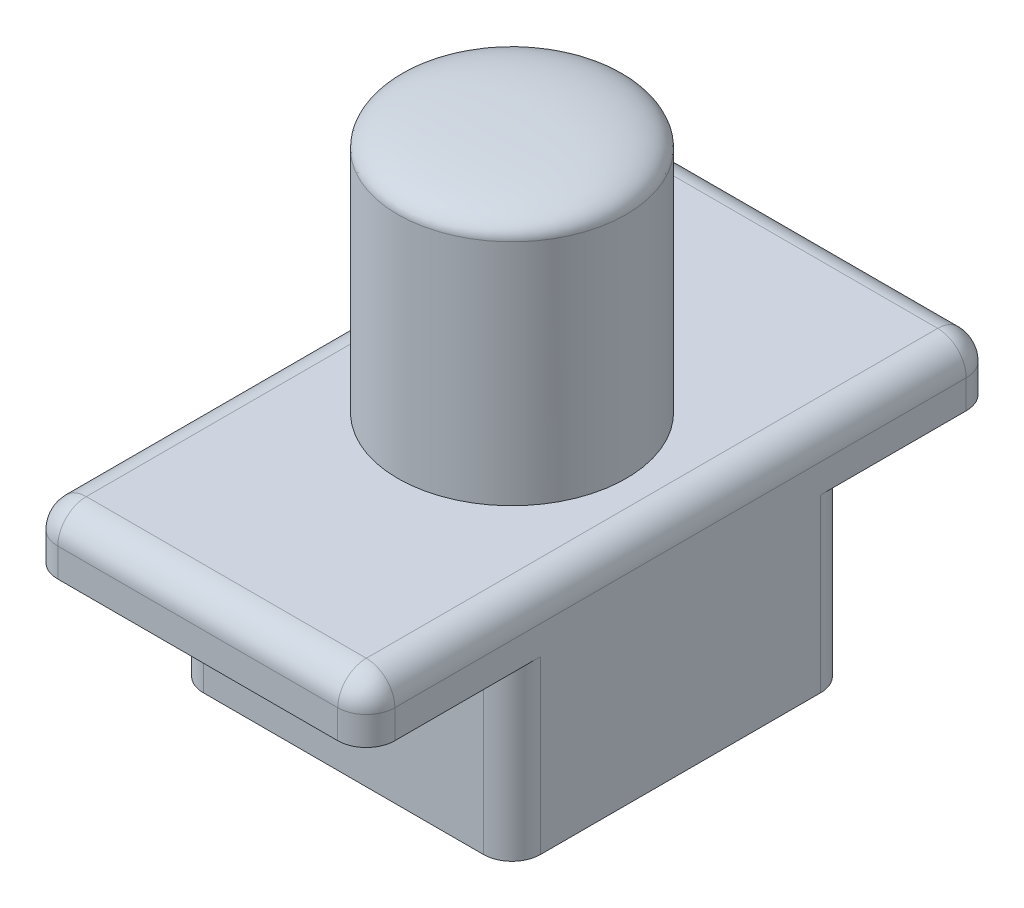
ISO-10303-21;
HEADER;
FILE_DESCRIPTION(('STEP AP214'),'2;1');
FILE_NAME('part.step','',(''),(''),'','','');
FILE_SCHEMA(('AUTOMOTIVE_DESIGN { 1 0 10303 214 1 1 1 1 }'));
ENDSEC;
DATA;
#1=APPLICATION_CONTEXT('core data for automotive mechanical design processes');
#2=APPLICATION_PROTOCOL_DEFINITION('international standard','automotive_design',2000,#1);
#3=PRODUCT_CONTEXT('',#1,'mechanical');
#4=PRODUCT('Part','Part','',(#3));
#5=PRODUCT_RELATED_PRODUCT_CATEGORY('part','',(#4));
#6=PRODUCT_DEFINITION_FORMATION('','',#4);
#7=PRODUCT_DEFINITION_CONTEXT('part definition',#1,'design');
#8=PRODUCT_DEFINITION('design','',#6,#7);
#9=PRODUCT_DEFINITION_SHAPE('','',#8);
#10=(LENGTH_UNIT() NAMED_UNIT(*) SI_UNIT(.MILLI.,.METRE.));
#11=(NAMED_UNIT(*) PLANE_ANGLE_UNIT() SI_UNIT($,.RADIAN.));
#12=(NAMED_UNIT(*) SI_UNIT($,.STERADIAN.) SOLID_ANGLE_UNIT());
#13=UNCERTAINTY_MEASURE_WITH_UNIT(LENGTH_MEASURE(1.E-05),#10,'distance_accuracy_value','');
#14=(GEOMETRIC_REPRESENTATION_CONTEXT(3) GLOBAL_UNCERTAINTY_ASSIGNED_CONTEXT((#13)) GLOBAL_UNIT_ASSIGNED_CONTEXT((#10,
#11,#12)) REPRESENTATION_CONTEXT('',''));
#15=CARTESIAN_POINT('',(0.,0.,0.));
#16=DIRECTION('',(0.,0.,1.));
#17=DIRECTION('',(1.,0.,0.));
#18=AXIS2_PLACEMENT_3D('',#15,#16,#17);
#19=CARTESIAN_POINT('',(2.95,4.,5.5));
#20=DIRECTION('',(0.,-1.,0.));
#21=DIRECTION('',(0.,0.,-1.));
#22=AXIS2_PLACEMENT_3D('',#19,#20,#21);
#23=PLANE('',#22);
#24=DIRECTION('',(0.,0.,1.));
#25=VECTOR('',#24,1.);
#26=CARTESIAN_POINT('',(-2.45,4.,5.5));
#27=LINE('',#26,#25);
#28=CARTESIAN_POINT('',(-2.45,4.,-5.));
#29=VERTEX_POINT('',#28);
#30=CARTESIAN_POINT('',(-2.45,4.,5.));
#31=VERTEX_POINT('',#30);
#32=EDGE_CURVE('E57',#29,#31,#27,.T.);
#33=ORIENTED_EDGE('',*,*,#32,.T.);
#34=DIRECTION('',(-1.,0.,0.));
#35=VECTOR('',#34,1.);
#36=CARTESIAN_POINT('',(2.95,4.,5.));
#37=LINE('',#36,#35);
#38=CARTESIAN_POINT('',(2.45,4.,5.));
#39=VERTEX_POINT('',#38);
#40=EDGE_CURVE('E387',#31,#39,#37,.F.);
#41=ORIENTED_EDGE('',*,*,#40,.T.);
#42=DIRECTION('',(0.,0.,1.));
#43=VECTOR('',#42,1.);
#44=CARTESIAN_POINT('',(2.45,4.,-5.5));
#45=LINE('',#44,#43);
#46=CARTESIAN_POINT('',(2.45,4.,-5.));
#47=VERTEX_POINT('',#46);
#48=EDGE_CURVE('E382',#39,#47,#45,.F.);
#49=ORIENTED_EDGE('',*,*,#48,.T.);
#50=DIRECTION('',(-1.,0.,0.));
#51=VECTOR('',#50,1.);
#52=CARTESIAN_POINT('',(2.95,4.,-5.));
#53=LINE('',#52,#51);
#54=EDGE_CURVE('E384',#47,#29,#53,.T.);
#55=ORIENTED_EDGE('',*,*,#54,.T.);
#56=EDGE_LOOP('',(#33,#41,#49,#55));
#57=FACE_BOUND('',#56,.T.);
#58=CARTESIAN_POINT('',(0.,4.,0.));
#59=DIRECTION('',(0.,-1.,0.));
#60=DIRECTION('',(0.,0.,-1.));
#61=AXIS2_PLACEMENT_3D('',#58,#59,#60);
#62=CIRCLE('',#61,2.);
#63=CARTESIAN_POINT('',(0.,4.,-2.));
#64=VERTEX_POINT('',#63);
#65=EDGE_CURVE('E451',#64,#64,#62,.F.);
#66=ORIENTED_EDGE('',*,*,#65,.F.);
#67=EDGE_LOOP('',(#66));
#68=FACE_BOUND('',#67,.T.);
#69=ADVANCED_FACE('F32',(#57,#68),#23,.F.);
#70=CARTESIAN_POINT('',(2.95,0.,-2.95));
#71=DIRECTION('',(0.,0.,1.));
#72=DIRECTION('',(0.,-1.,0.));
#73=AXIS2_PLACEMENT_3D('',#70,#71,#72);
#74=PLANE('',#73);
#75=DIRECTION('',(-1.,0.,0.));
#76=VECTOR('',#75,1.);
#77=CARTESIAN_POINT('',(2.95,0.,-2.95));
#78=LINE('',#77,#76);
#79=CARTESIAN_POINT('',(2.45,0.,-2.95));
#80=VERTEX_POINT('',#79);
#81=CARTESIAN_POINT('',(-2.45,0.,-2.95));
#82=VERTEX_POINT('',#81);
#83=EDGE_CURVE('E433',#80,#82,#78,.T.);
#84=ORIENTED_EDGE('',*,*,#83,.T.);
#85=DIRECTION('',(0.,1.,0.));
#86=VECTOR('',#85,1.);
#87=CARTESIAN_POINT('',(-2.45,0.,-2.95));
#88=LINE('',#87,#86);
#89=CARTESIAN_POINT('',(-2.45,3.,-2.95));
#90=VERTEX_POINT('',#89);
#91=EDGE_CURVE('E480',#82,#90,#88,.T.);
#92=ORIENTED_EDGE('',*,*,#91,.T.);
#93=DIRECTION('',(-1.,0.,0.));
#94=VECTOR('',#93,1.);
#95=CARTESIAN_POINT('',(2.95,3.,-2.95));
#96=LINE('',#95,#94);
#97=CARTESIAN_POINT('',(2.45,3.,-2.95));
#98=VERTEX_POINT('',#97);
#99=EDGE_CURVE('E448',#98,#90,#96,.T.);
#100=ORIENTED_EDGE('',*,*,#99,.F.);
#101=DIRECTION('',(0.,1.,0.));
#102=VECTOR('',#101,1.);
#103=CARTESIAN_POINT('',(2.45,0.,-2.95));
#104=LINE('',#103,#102);
#105=EDGE_CURVE('E478',#98,#80,#104,.F.);
#106=ORIENTED_EDGE('',*,*,#105,.T.);
#107=EDGE_LOOP('',(#84,#92,#100,#106));
#108=FACE_BOUND('',#107,.T.);
#109=ADVANCED_FACE('F278',(#108),#74,.F.);
#110=CARTESIAN_POINT('',(2.95,3.,-2.95));
#111=DIRECTION('',(0.,1.,0.));
#112=DIRECTION('',(0.,0.,1.));
#113=AXIS2_PLACEMENT_3D('',#110,#111,#112);
#114=PLANE('',#113);
#115=DIRECTION('',(0.,0.,-1.));
#116=VECTOR('',#115,1.);
#117=CARTESIAN_POINT('',(-2.95,3.,-2.95));
#118=LINE('',#117,#116);
#119=CARTESIAN_POINT('',(-2.95,3.,-2.45));
#120=VERTEX_POINT('',#119);
#121=CARTESIAN_POINT('',(-2.95,3.,-5.));
#122=VERTEX_POINT('',#121);
#123=EDGE_CURVE('E417',#120,#122,#118,.T.);
#124=ORIENTED_EDGE('',*,*,#123,.T.);
#125=CARTESIAN_POINT('',(-2.45,3.,-5.));
#126=DIRECTION('',(0.,1.,0.));
#127=DIRECTION('',(0.,0.,1.));
#128=AXIS2_PLACEMENT_3D('',#125,#126,#127);
#129=CIRCLE('',#128,0.5);
#130=CARTESIAN_POINT('',(-2.45,3.,-5.5));
#131=VERTEX_POINT('',#130);
#132=EDGE_CURVE('E380',#122,#131,#129,.F.);
#133=ORIENTED_EDGE('',*,*,#132,.T.);
#134=DIRECTION('',(-1.,0.,0.));
#135=VECTOR('',#134,1.);
#136=CARTESIAN_POINT('',(2.95,3.,-5.5));
#137=LINE('',#136,#135);
#138=CARTESIAN_POINT('',(2.45,3.,-5.5));
#139=VERTEX_POINT('',#138);
#140=EDGE_CURVE('E445',#139,#131,#137,.T.);
#141=ORIENTED_EDGE('',*,*,#140,.F.);
#142=CARTESIAN_POINT('',(2.45,3.,-5.));
#143=DIRECTION('',(0.,1.,0.));
#144=DIRECTION('',(0.,0.,1.));
#145=AXIS2_PLACEMENT_3D('',#142,#143,#144);
#146=CIRCLE('',#145,0.5);
#147=CARTESIAN_POINT('',(2.95,3.,-5.));
#148=VERTEX_POINT('',#147);
#149=EDGE_CURVE('E378',#139,#148,#146,.F.);
#150=ORIENTED_EDGE('',*,*,#149,.T.);
#151=DIRECTION('',(0.,0.,-1.));
#152=VECTOR('',#151,1.);
#153=CARTESIAN_POINT('',(2.95,3.,-2.95));
#154=LINE('',#153,#152);
#155=CARTESIAN_POINT('',(2.95,3.,-2.45));
#156=VERTEX_POINT('',#155);
#157=EDGE_CURVE('E432',#156,#148,#154,.T.);
#158=ORIENTED_EDGE('',*,*,#157,.F.);
#159=CARTESIAN_POINT('',(2.45,3.,-2.45));
#160=DIRECTION('',(0.,1.,0.));
#161=DIRECTION('',(0.,0.,1.));
#162=AXIS2_PLACEMENT_3D('',#159,#160,#161);
#163=CIRCLE('',#162,0.5);
#164=EDGE_CURVE('E41',#156,#98,#163,.T.);
#165=ORIENTED_EDGE('',*,*,#164,.T.);
#166=ORIENTED_EDGE('',*,*,#99,.T.);
#167=CARTESIAN_POINT('',(-2.45,3.,-2.45));
#168=DIRECTION('',(0.,1.,0.));
#169=DIRECTION('',(0.,0.,1.));
#170=AXIS2_PLACEMENT_3D('',#167,#168,#169);
#171=CIRCLE('',#170,0.5);
#172=EDGE_CURVE('E391',#90,#120,#171,.T.);
#173=ORIENTED_EDGE('',*,*,#172,.T.);
#174=EDGE_LOOP('',(#124,#133,#141,#150,#158,#165,#166,#173));
#175=FACE_BOUND('',#174,.T.);
#176=ADVANCED_FACE('F281',(#175),#114,.F.);
#177=CARTESIAN_POINT('',(2.95,3.,-5.5));
#178=DIRECTION('',(0.,0.,1.));
#179=DIRECTION('',(1.,0.,0.));
#180=AXIS2_PLACEMENT_3D('',#177,#178,#179);
#181=PLANE('',#180);
#182=ORIENTED_EDGE('',*,*,#140,.T.);
#183=DIRECTION('',(0.,1.,0.));
#184=VECTOR('',#183,1.);
#185=CARTESIAN_POINT('',(-2.45,3.,-5.5));
#186=LINE('',#185,#184);
#187=CARTESIAN_POINT('',(-2.45,3.5,-5.5));
#188=VERTEX_POINT('',#187);
#189=EDGE_CURVE('E371',#131,#188,#186,.T.);
#190=ORIENTED_EDGE('',*,*,#189,.T.);
#191=DIRECTION('',(-1.,0.,0.));
#192=VECTOR('',#191,1.);
#193=CARTESIAN_POINT('',(2.95,3.5,-5.5));
#194=LINE('',#193,#192);
#195=CARTESIAN_POINT('',(2.45,3.5,-5.5));
#196=VERTEX_POINT('',#195);
#197=EDGE_CURVE('E363',#188,#196,#194,.F.);
#198=ORIENTED_EDGE('',*,*,#197,.T.);
#199=DIRECTION('',(0.,1.,0.));
#200=VECTOR('',#199,1.);
#201=CARTESIAN_POINT('',(2.45,3.,-5.5));
#202=LINE('',#201,#200);
#203=EDGE_CURVE('E368',#196,#139,#202,.F.);
#204=ORIENTED_EDGE('',*,*,#203,.T.);
#205=EDGE_LOOP('',(#182,#190,#198,#204));
#206=FACE_BOUND('',#205,.T.);
#207=ADVANCED_FACE('F274',(#206),#181,.F.);
#208=CARTESIAN_POINT('',(2.95,3.,5.5));
#209=DIRECTION('',(0.,0.,-1.));
#210=DIRECTION('',(-1.,0.,0.));
#211=AXIS2_PLACEMENT_3D('',#208,#209,#210);
#212=PLANE('',#211);
#213=DIRECTION('',(-1.,0.,0.));
#214=VECTOR('',#213,1.);
#215=CARTESIAN_POINT('',(2.95,3.,5.5));
#216=LINE('',#215,#214);
#217=CARTESIAN_POINT('',(2.45,3.,5.5));
#218=VERTEX_POINT('',#217);
#219=CARTESIAN_POINT('',(-2.45,3.,5.5));
#220=VERTEX_POINT('',#219);
#221=EDGE_CURVE('E442',#218,#220,#216,.T.);
#222=ORIENTED_EDGE('',*,*,#221,.F.);
#223=DIRECTION('',(0.,-1.,0.));
#224=VECTOR('',#223,1.);
#225=CARTESIAN_POINT('',(2.45,4.,5.5));
#226=LINE('',#225,#224);
#227=CARTESIAN_POINT('',(2.45,3.5,5.5));
#228=VERTEX_POINT('',#227);
#229=EDGE_CURVE('E369',#218,#228,#226,.F.);
#230=ORIENTED_EDGE('',*,*,#229,.T.);
#231=DIRECTION('',(-1.,0.,0.));
#232=VECTOR('',#231,1.);
#233=CARTESIAN_POINT('',(2.95,3.5,5.5));
#234=LINE('',#233,#232);
#235=CARTESIAN_POINT('',(-2.45,3.5,5.5));
#236=VERTEX_POINT('',#235);
#237=EDGE_CURVE('E500',#228,#236,#234,.T.);
#238=ORIENTED_EDGE('',*,*,#237,.T.);
#239=DIRECTION('',(0.,-1.,0.));
#240=VECTOR('',#239,1.);
#241=CARTESIAN_POINT('',(-2.45,3.,5.5));
#242=LINE('',#241,#240);
#243=EDGE_CURVE('E373',#236,#220,#242,.T.);
#244=ORIENTED_EDGE('',*,*,#243,.T.);
#245=EDGE_LOOP('',(#222,#230,#238,#244));
#246=FACE_BOUND('',#245,.T.);
#247=ADVANCED_FACE('F270',(#246),#212,.F.);
#248=CARTESIAN_POINT('',(2.95,3.,2.95));
#249=DIRECTION('',(0.,1.,0.));
#250=DIRECTION('',(0.,0.,1.));
#251=AXIS2_PLACEMENT_3D('',#248,#249,#250);
#252=PLANE('',#251);
#253=DIRECTION('',(0.,0.,-1.));
#254=VECTOR('',#253,1.);
#255=CARTESIAN_POINT('',(2.95,3.,2.95));
#256=LINE('',#255,#254);
#257=CARTESIAN_POINT('',(2.95,3.,5.));
#258=VERTEX_POINT('',#257);
#259=CARTESIAN_POINT('',(2.95,3.,2.45));
#260=VERTEX_POINT('',#259);
#261=EDGE_CURVE('E541',#258,#260,#256,.T.);
#262=ORIENTED_EDGE('',*,*,#261,.F.);
#263=CARTESIAN_POINT('',(2.45,3.,5.));
#264=DIRECTION('',(0.,1.,0.));
#265=DIRECTION('',(0.,0.,1.));
#266=AXIS2_PLACEMENT_3D('',#263,#264,#265);
#267=CIRCLE('',#266,0.5);
#268=EDGE_CURVE('E498',#258,#218,#267,.F.);
#269=ORIENTED_EDGE('',*,*,#268,.T.);
#270=ORIENTED_EDGE('',*,*,#221,.T.);
#271=CARTESIAN_POINT('',(-2.45,3.,5.));
#272=DIRECTION('',(0.,1.,0.));
#273=DIRECTION('',(0.,0.,1.));
#274=AXIS2_PLACEMENT_3D('',#271,#272,#273);
#275=CIRCLE('',#274,0.5);
#276=CARTESIAN_POINT('',(-2.95,3.,5.));
#277=VERTEX_POINT('',#276);
#278=EDGE_CURVE('E496',#220,#277,#275,.F.);
#279=ORIENTED_EDGE('',*,*,#278,.T.);
#280=DIRECTION('',(0.,0.,-1.));
#281=VECTOR('',#280,1.);
#282=CARTESIAN_POINT('',(-2.95,3.,2.95));
#283=LINE('',#282,#281);
#284=CARTESIAN_POINT('',(-2.95,3.,2.45));
#285=VERTEX_POINT('',#284);
#286=EDGE_CURVE('E421',#277,#285,#283,.T.);
#287=ORIENTED_EDGE('',*,*,#286,.T.);
#288=CARTESIAN_POINT('',(-2.45,3.,2.45));
#289=DIRECTION('',(0.,1.,0.));
#290=DIRECTION('',(0.,0.,1.));
#291=AXIS2_PLACEMENT_3D('',#288,#289,#290);
#292=CIRCLE('',#291,0.5);
#293=CARTESIAN_POINT('',(-2.45,3.,2.95));
#294=VERTEX_POINT('',#293);
#295=EDGE_CURVE('E389',#285,#294,#292,.T.);
#296=ORIENTED_EDGE('',*,*,#295,.T.);
#297=DIRECTION('',(-1.,0.,0.));
#298=VECTOR('',#297,1.);
#299=CARTESIAN_POINT('',(2.95,3.,2.95));
#300=LINE('',#299,#298);
#301=CARTESIAN_POINT('',(2.45,3.,2.95));
#302=VERTEX_POINT('',#301);
#303=EDGE_CURVE('E439',#302,#294,#300,.T.);
#304=ORIENTED_EDGE('',*,*,#303,.F.);
#305=CARTESIAN_POINT('',(2.45,3.,2.45));
#306=DIRECTION('',(0.,1.,0.));
#307=DIRECTION('',(0.,0.,1.));
#308=AXIS2_PLACEMENT_3D('',#305,#306,#307);
#309=CIRCLE('',#308,0.5);
#310=EDGE_CURVE('E11',#302,#260,#309,.T.);
#311=ORIENTED_EDGE('',*,*,#310,.T.);
#312=EDGE_LOOP('',(#262,#269,#270,#279,#287,#296,#304,#311));
#313=FACE_BOUND('',#312,.T.);
#314=ADVANCED_FACE('F266',(#313),#252,.F.);
#315=CARTESIAN_POINT('',(2.95,0.,2.95));
#316=DIRECTION('',(0.,0.,-1.));
#317=DIRECTION('',(-1.,0.,0.));
#318=AXIS2_PLACEMENT_3D('',#315,#316,#317);
#319=PLANE('',#318);
#320=ORIENTED_EDGE('',*,*,#303,.T.);
#321=DIRECTION('',(0.,-1.,0.));
#322=VECTOR('',#321,1.);
#323=CARTESIAN_POINT('',(-2.45,0.,2.95));
#324=LINE('',#323,#322);
#325=CARTESIAN_POINT('',(-2.45,0.,2.95));
#326=VERTEX_POINT('',#325);
#327=EDGE_CURVE('E456',#294,#326,#324,.T.);
#328=ORIENTED_EDGE('',*,*,#327,.T.);
#329=DIRECTION('',(-1.,0.,0.));
#330=VECTOR('',#329,1.);
#331=CARTESIAN_POINT('',(2.95,0.,2.95));
#332=LINE('',#331,#330);
#333=CARTESIAN_POINT('',(2.45,0.,2.95));
#334=VERTEX_POINT('',#333);
#335=EDGE_CURVE('E436',#334,#326,#332,.T.);
#336=ORIENTED_EDGE('',*,*,#335,.F.);
#337=DIRECTION('',(0.,-1.,0.));
#338=VECTOR('',#337,1.);
#339=CARTESIAN_POINT('',(2.45,3.,2.95));
#340=LINE('',#339,#338);
#341=EDGE_CURVE('E454',#334,#302,#340,.F.);
#342=ORIENTED_EDGE('',*,*,#341,.T.);
#343=EDGE_LOOP('',(#320,#328,#336,#342));
#344=FACE_BOUND('',#343,.T.);
#345=ADVANCED_FACE('F262',(#344),#319,.F.);
#346=CARTESIAN_POINT('',(2.95,0.,-2.95));
#347=DIRECTION('',(0.,1.,0.));
#348=DIRECTION('',(0.,0.,1.));
#349=AXIS2_PLACEMENT_3D('',#346,#347,#348);
#350=PLANE('',#349);
#351=DIRECTION('',(0.,0.,-1.));
#352=VECTOR('',#351,1.);
#353=CARTESIAN_POINT('',(-1.9989,0.,1.9989));
#354=LINE('',#353,#352);
#355=CARTESIAN_POINT('',(-1.9989,0.,1.9989));
#356=VERTEX_POINT('',#355);
#357=CARTESIAN_POINT('',(-1.9989,0.,-1.9989));
#358=VERTEX_POINT('',#357);
#359=EDGE_CURVE('E219',#356,#358,#354,.T.);
#360=ORIENTED_EDGE('',*,*,#359,.F.);
#361=DIRECTION('',(-1.,0.,0.));
#362=VECTOR('',#361,1.);
#363=CARTESIAN_POINT('',(1.9989,0.,1.9989));
#364=LINE('',#363,#362);
#365=CARTESIAN_POINT('',(1.9989,0.,1.9989));
#366=VERTEX_POINT('',#365);
#367=EDGE_CURVE('E49',#366,#356,#364,.T.);
#368=ORIENTED_EDGE('',*,*,#367,.F.);
#369=DIRECTION('',(0.,0.,1.));
#370=VECTOR('',#369,1.);
#371=CARTESIAN_POINT('',(1.9989,0.,1.9989));
#372=LINE('',#371,#370);
#373=CARTESIAN_POINT('',(1.9989,0.,-1.9989));
#374=VERTEX_POINT('',#373);
#375=EDGE_CURVE('E207',#374,#366,#372,.T.);
#376=ORIENTED_EDGE('',*,*,#375,.F.);
#377=DIRECTION('',(1.,0.,0.));
#378=VECTOR('',#377,1.);
#379=CARTESIAN_POINT('',(1.9989,0.,-1.9989));
#380=LINE('',#379,#378);
#381=EDGE_CURVE('E210',#358,#374,#380,.T.);
#382=ORIENTED_EDGE('',*,*,#381,.F.);
#383=EDGE_LOOP('',(#360,#368,#376,#382));
#384=FACE_BOUND('',#383,.T.);
#385=ORIENTED_EDGE('',*,*,#335,.T.);
#386=CARTESIAN_POINT('',(-2.45,0.,2.45));
#387=DIRECTION('',(0.,1.,0.));
#388=DIRECTION('',(0.,0.,1.));
#389=AXIS2_PLACEMENT_3D('',#386,#387,#388);
#390=CIRCLE('',#389,0.5);
#391=CARTESIAN_POINT('',(-2.95,0.,2.45));
#392=VERTEX_POINT('',#391);
#393=EDGE_CURVE('E465',#326,#392,#390,.F.);
#394=ORIENTED_EDGE('',*,*,#393,.T.);
#395=DIRECTION('',(0.,0.,-1.));
#396=VECTOR('',#395,1.);
#397=CARTESIAN_POINT('',(-2.95,0.,-2.95));
#398=LINE('',#397,#396);
#399=CARTESIAN_POINT('',(-2.95,0.,-2.45));
#400=VERTEX_POINT('',#399);
#401=EDGE_CURVE('E424',#392,#400,#398,.T.);
#402=ORIENTED_EDGE('',*,*,#401,.T.);
#403=CARTESIAN_POINT('',(-2.45,0.,-2.45));
#404=DIRECTION('',(0.,1.,0.));
#405=DIRECTION('',(0.,0.,1.));
#406=AXIS2_PLACEMENT_3D('',#403,#404,#405);
#407=CIRCLE('',#406,0.5);
#408=EDGE_CURVE('E463',#400,#82,#407,.F.);
#409=ORIENTED_EDGE('',*,*,#408,.T.);
#410=ORIENTED_EDGE('',*,*,#83,.F.);
#411=CARTESIAN_POINT('',(2.45,0.,-2.45));
#412=DIRECTION('',(0.,1.,0.));
#413=DIRECTION('',(0.,0.,1.));
#414=AXIS2_PLACEMENT_3D('',#411,#412,#413);
#415=CIRCLE('',#414,0.5);
#416=CARTESIAN_POINT('',(2.95,0.,-2.45));
#417=VERTEX_POINT('',#416);
#418=EDGE_CURVE('E461',#80,#417,#415,.F.);
#419=ORIENTED_EDGE('',*,*,#418,.T.);
#420=DIRECTION('',(0.,0.,-1.));
#421=VECTOR('',#420,1.);
#422=CARTESIAN_POINT('',(2.95,0.,-2.95));
#423=LINE('',#422,#421);
#424=CARTESIAN_POINT('',(2.95,0.,2.45));
#425=VERTEX_POINT('',#424);
#426=EDGE_CURVE('E427',#425,#417,#423,.T.);
#427=ORIENTED_EDGE('',*,*,#426,.F.);
#428=CARTESIAN_POINT('',(2.45,0.,2.45));
#429=DIRECTION('',(0.,1.,0.));
#430=DIRECTION('',(0.,0.,1.));
#431=AXIS2_PLACEMENT_3D('',#428,#429,#430);
#432=CIRCLE('',#431,0.5);
#433=EDGE_CURVE('E459',#425,#334,#432,.F.);
#434=ORIENTED_EDGE('',*,*,#433,.T.);
#435=EDGE_LOOP('',(#385,#394,#402,#409,#410,#419,#427,#434));
#436=FACE_BOUND('',#435,.T.);
#437=ADVANCED_FACE('F255',(#384,#436),#350,.F.);
#438=CARTESIAN_POINT('',(2.95,3.,-2.95));
#439=DIRECTION('',(1.,0.,0.));
#440=DIRECTION('',(0.,0.,-1.));
#441=AXIS2_PLACEMENT_3D('',#438,#439,#440);
#442=PLANE('',#441);
#443=ORIENTED_EDGE('',*,*,#426,.T.);
#444=DIRECTION('',(0.,1.,0.));
#445=VECTOR('',#444,1.);
#446=CARTESIAN_POINT('',(2.95,3.,-2.45));
#447=LINE('',#446,#445);
#448=EDGE_CURVE('E493',#417,#156,#447,.T.);
#449=ORIENTED_EDGE('',*,*,#448,.T.);
#450=ORIENTED_EDGE('',*,*,#157,.T.);
#451=DIRECTION('',(0.,1.,0.));
#452=VECTOR('',#451,1.);
#453=CARTESIAN_POINT('',(2.95,4.,-5.));
#454=LINE('',#453,#452);
#455=CARTESIAN_POINT('',(2.95,3.5,-5.));
#456=VERTEX_POINT('',#455);
#457=EDGE_CURVE('E485',#148,#456,#454,.T.);
#458=ORIENTED_EDGE('',*,*,#457,.T.);
#459=DIRECTION('',(0.,0.,1.));
#460=VECTOR('',#459,1.);
#461=CARTESIAN_POINT('',(2.95,3.5,5.5));
#462=LINE('',#461,#460);
#463=CARTESIAN_POINT('',(2.95,3.5,5.));
#464=VERTEX_POINT('',#463);
#465=EDGE_CURVE('E483',#456,#464,#462,.T.);
#466=ORIENTED_EDGE('',*,*,#465,.T.);
#467=DIRECTION('',(0.,-1.,0.));
#468=VECTOR('',#467,1.);
#469=CARTESIAN_POINT('',(2.95,3.,5.));
#470=LINE('',#469,#468);
#471=EDGE_CURVE('E487',#464,#258,#470,.T.);
#472=ORIENTED_EDGE('',*,*,#471,.T.);
#473=ORIENTED_EDGE('',*,*,#261,.T.);
#474=DIRECTION('',(0.,-1.,0.));
#475=VECTOR('',#474,1.);
#476=CARTESIAN_POINT('',(2.95,0.,2.45));
#477=LINE('',#476,#475);
#478=EDGE_CURVE('E490',#260,#425,#477,.T.);
#479=ORIENTED_EDGE('',*,*,#478,.T.);
#480=EDGE_LOOP('',(#443,#449,#450,#458,#466,#472,#473,#479));
#481=FACE_BOUND('',#480,.T.);
#482=ADVANCED_FACE('F252',(#481),#442,.T.);
#483=CARTESIAN_POINT('',(-2.95,3.,-2.95));
#484=DIRECTION('',(1.,0.,0.));
#485=DIRECTION('',(0.,0.,-1.));
#486=AXIS2_PLACEMENT_3D('',#483,#484,#485);
#487=PLANE('',#486);
#488=ORIENTED_EDGE('',*,*,#401,.F.);
#489=DIRECTION('',(0.,-1.,0.));
#490=VECTOR('',#489,1.);
#491=CARTESIAN_POINT('',(-2.95,3.,2.45));
#492=LINE('',#491,#490);
#493=EDGE_CURVE('E475',#392,#285,#492,.F.);
#494=ORIENTED_EDGE('',*,*,#493,.T.);
#495=ORIENTED_EDGE('',*,*,#286,.F.);
#496=DIRECTION('',(0.,-1.,0.));
#497=VECTOR('',#496,1.);
#498=CARTESIAN_POINT('',(-2.95,3.,5.));
#499=LINE('',#498,#497);
#500=CARTESIAN_POINT('',(-2.95,3.5,5.));
#501=VERTEX_POINT('',#500);
#502=EDGE_CURVE('E471',#277,#501,#499,.F.);
#503=ORIENTED_EDGE('',*,*,#502,.T.);
#504=DIRECTION('',(0.,0.,1.));
#505=VECTOR('',#504,1.);
#506=CARTESIAN_POINT('',(-2.95,3.5,-2.95));
#507=LINE('',#506,#505);
#508=CARTESIAN_POINT('',(-2.95,3.5,-5.));
#509=VERTEX_POINT('',#508);
#510=EDGE_CURVE('E467',#501,#509,#507,.F.);
#511=ORIENTED_EDGE('',*,*,#510,.T.);
#512=DIRECTION('',(0.,1.,0.));
#513=VECTOR('',#512,1.);
#514=CARTESIAN_POINT('',(-2.95,3.,-5.));
#515=LINE('',#514,#513);
#516=EDGE_CURVE('E469',#509,#122,#515,.F.);
#517=ORIENTED_EDGE('',*,*,#516,.T.);
#518=ORIENTED_EDGE('',*,*,#123,.F.);
#519=DIRECTION('',(0.,1.,0.));
#520=VECTOR('',#519,1.);
#521=CARTESIAN_POINT('',(-2.95,3.,-2.45));
#522=LINE('',#521,#520);
#523=EDGE_CURVE('E473',#120,#400,#522,.F.);
#524=ORIENTED_EDGE('',*,*,#523,.T.);
#525=EDGE_LOOP('',(#488,#494,#495,#503,#511,#517,#518,#524));
#526=FACE_BOUND('',#525,.T.);
#527=ADVANCED_FACE('F250',(#526),#487,.F.);
#528=CARTESIAN_POINT('',(0.,8.,0.));
#529=DIRECTION('',(0.,-1.,0.));
#530=DIRECTION('',(0.,0.,-1.));
#531=AXIS2_PLACEMENT_3D('',#528,#529,#530);
#532=CYLINDRICAL_SURFACE('',#531,2.);
#533=CARTESIAN_POINT('',(0.,8.,0.));
#534=DIRECTION('',(0.,1.,0.));
#535=DIRECTION('',(0.,0.,1.));
#536=AXIS2_PLACEMENT_3D('',#533,#534,#535);
#537=CIRCLE('',#536,2.);
#538=CARTESIAN_POINT('',(0.,8.,2.));
#539=VERTEX_POINT('',#538);
#540=EDGE_CURVE('E234',#539,#539,#537,.T.);
#541=ORIENTED_EDGE('',*,*,#540,.F.);
#542=EDGE_LOOP('',(#541));
#543=FACE_BOUND('',#542,.T.);
#544=ORIENTED_EDGE('',*,*,#65,.T.);
#545=EDGE_LOOP('',(#544));
#546=FACE_BOUND('',#545,.T.);
#547=ADVANCED_FACE('F245',(#543,#546),#532,.T.);
#548=CARTESIAN_POINT('',(2.,8.,0.));
#549=CARTESIAN_POINT('',(2.00042080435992,8.04540719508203,0.));
#550=CARTESIAN_POINT('',(1.9758450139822,8.11837371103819,0.));
#551=CARTESIAN_POINT('',(1.90673526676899,8.1993627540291,0.));
#552=CARTESIAN_POINT('',(1.81248506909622,8.26278086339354,0.));
#553=CARTESIAN_POINT('',(1.66873988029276,8.32926060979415,0.));
#554=CARTESIAN_POINT('',(1.46486612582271,8.38816872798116,0.));
#555=CARTESIAN_POINT('',(1.19725140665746,8.4358929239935,0.));
#556=CARTESIAN_POINT('',(0.913581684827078,8.46756258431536,0.));
#557=CARTESIAN_POINT('',(0.519523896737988,8.49395776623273,0.));
#558=CARTESIAN_POINT('',(0.210223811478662,8.49999780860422,0.));
#559=CARTESIAN_POINT('',(0.,8.5000008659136,0.));
#560=B_SPLINE_CURVE_WITH_KNOTS('',3,(#548,#549,#550,#551,#552,#553,#554,#555,#556,#557,#558,
#559),.UNSPECIFIED.,.F.,.F.,(4,1,1,1,1,1,1,1,1,4),(4.78900180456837E-13,0.0534990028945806,
0.115999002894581,0.178499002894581,0.240999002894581,0.365999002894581,0.490999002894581,
0.615999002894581,0.740999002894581,0.990999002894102),.UNSPECIFIED.);
#561=CARTESIAN_POINT('',(0.,8.,0.));
#562=DIRECTION('',(0.,-1.,0.));
#563=AXIS1_PLACEMENT('',#561,#562);
#564=SURFACE_OF_REVOLUTION('',#560,#563);
#565=CARTESIAN_POINT('',(0.,8.5000008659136,0.));
#566=VERTEX_POINT('',#565);
#567=VERTEX_LOOP('',#566);
#568=FACE_BOUND('',#567,.T.);
#569=ORIENTED_EDGE('',*,*,#540,.T.);
#570=EDGE_LOOP('',(#569));
#571=FACE_BOUND('',#570,.T.);
#572=ADVANCED_FACE('F240',(#568,#571),#564,.F.);
#573=CARTESIAN_POINT('',(-2.45,0.,2.45));
#574=DIRECTION('',(0.,-1.,0.));
#575=DIRECTION('',(0.,0.,-1.));
#576=AXIS2_PLACEMENT_3D('',#573,#574,#575);
#577=CYLINDRICAL_SURFACE('',#576,0.5);
#578=ORIENTED_EDGE('',*,*,#295,.F.);
#579=ORIENTED_EDGE('',*,*,#493,.F.);
#580=ORIENTED_EDGE('',*,*,#393,.F.);
#581=ORIENTED_EDGE('',*,*,#327,.F.);
#582=EDGE_LOOP('',(#578,#579,#580,#581));
#583=FACE_BOUND('',#582,.T.);
#584=ADVANCED_FACE('F244',(#583),#577,.T.);
#585=CARTESIAN_POINT('',(-2.45,0.,-2.45));
#586=DIRECTION('',(0.,1.,0.));
#587=DIRECTION('',(0.,0.,1.));
#588=AXIS2_PLACEMENT_3D('',#585,#586,#587);
#589=CYLINDRICAL_SURFACE('',#588,0.5);
#590=ORIENTED_EDGE('',*,*,#408,.F.);
#591=ORIENTED_EDGE('',*,*,#523,.F.);
#592=ORIENTED_EDGE('',*,*,#172,.F.);
#593=ORIENTED_EDGE('',*,*,#91,.F.);
#594=EDGE_LOOP('',(#590,#591,#592,#593));
#595=FACE_BOUND('',#594,.T.);
#596=ADVANCED_FACE('F291',(#595),#589,.T.);
#597=CARTESIAN_POINT('',(2.45,3.,-2.45));
#598=DIRECTION('',(0.,-1.,0.));
#599=DIRECTION('',(0.,0.,-1.));
#600=AXIS2_PLACEMENT_3D('',#597,#598,#599);
#601=CYLINDRICAL_SURFACE('',#600,0.5);
#602=ORIENTED_EDGE('',*,*,#418,.F.);
#603=ORIENTED_EDGE('',*,*,#105,.F.);
#604=ORIENTED_EDGE('',*,*,#164,.F.);
#605=ORIENTED_EDGE('',*,*,#448,.F.);
#606=EDGE_LOOP('',(#602,#603,#604,#605));
#607=FACE_BOUND('',#606,.T.);
#608=ADVANCED_FACE('F295',(#607),#601,.T.);
#609=CARTESIAN_POINT('',(2.45,3.,2.45));
#610=DIRECTION('',(0.,1.,0.));
#611=DIRECTION('',(0.,0.,1.));
#612=AXIS2_PLACEMENT_3D('',#609,#610,#611);
#613=CYLINDRICAL_SURFACE('',#612,0.5);
#614=ORIENTED_EDGE('',*,*,#310,.F.);
#615=ORIENTED_EDGE('',*,*,#341,.F.);
#616=ORIENTED_EDGE('',*,*,#433,.F.);
#617=ORIENTED_EDGE('',*,*,#478,.F.);
#618=EDGE_LOOP('',(#614,#615,#616,#617));
#619=FACE_BOUND('',#618,.T.);
#620=ADVANCED_FACE('F299',(#619),#613,.T.);
#621=CARTESIAN_POINT('',(-2.45,3.,-5.));
#622=DIRECTION('',(0.,1.,0.));
#623=DIRECTION('',(0.,0.,1.));
#624=AXIS2_PLACEMENT_3D('',#621,#622,#623);
#625=CYLINDRICAL_SURFACE('',#624,0.5);
#626=CARTESIAN_POINT('',(-2.45,3.5,-5.));
#627=DIRECTION('',(0.,1.,0.));
#628=DIRECTION('',(0.,0.,1.));
#629=AXIS2_PLACEMENT_3D('',#626,#627,#628);
#630=CIRCLE('',#629,0.5);
#631=EDGE_CURVE('E36',#188,#509,#630,.T.);
#632=ORIENTED_EDGE('',*,*,#631,.F.);
#633=ORIENTED_EDGE('',*,*,#189,.F.);
#634=ORIENTED_EDGE('',*,*,#132,.F.);
#635=ORIENTED_EDGE('',*,*,#516,.F.);
#636=EDGE_LOOP('',(#632,#633,#634,#635));
#637=FACE_BOUND('',#636,.T.);
#638=ADVANCED_FACE('F34',(#637),#625,.T.);
#639=CARTESIAN_POINT('',(-2.45,3.5,-5.));
#640=DIRECTION('',(0.,0.,1.));
#641=DIRECTION('',(1.,0.,0.));
#642=AXIS2_PLACEMENT_3D('',#639,#640,#641);
#643=SPHERICAL_SURFACE('',#642,0.5);
#644=CARTESIAN_POINT('',(-2.45,3.5,-5.));
#645=DIRECTION('',(-1.,0.,0.));
#646=DIRECTION('',(0.,0.,1.));
#647=AXIS2_PLACEMENT_3D('',#644,#645,#646);
#648=CIRCLE('',#647,0.5);
#649=EDGE_CURVE('E354',#188,#29,#648,.F.);
#650=ORIENTED_EDGE('',*,*,#649,.F.);
#651=ORIENTED_EDGE('',*,*,#631,.T.);
#652=CARTESIAN_POINT('',(-2.45,3.5,-5.));
#653=DIRECTION('',(0.,0.,-1.));
#654=DIRECTION('',(-1.,0.,0.));
#655=AXIS2_PLACEMENT_3D('',#652,#653,#654);
#656=CIRCLE('',#655,0.5);
#657=EDGE_CURVE('E358',#29,#509,#656,.F.);
#658=ORIENTED_EDGE('',*,*,#657,.F.);
#659=EDGE_LOOP('',(#650,#651,#658));
#660=FACE_BOUND('',#659,.T.);
#661=ADVANCED_FACE('F342',(#660),#643,.T.);
#662=CARTESIAN_POINT('',(-2.45,3.,5.));
#663=DIRECTION('',(0.,-1.,0.));
#664=DIRECTION('',(0.,0.,-1.));
#665=AXIS2_PLACEMENT_3D('',#662,#663,#664);
#666=CYLINDRICAL_SURFACE('',#665,0.5);
#667=ORIENTED_EDGE('',*,*,#278,.F.);
#668=ORIENTED_EDGE('',*,*,#243,.F.);
#669=CARTESIAN_POINT('',(-2.45,3.5,5.));
#670=DIRECTION('',(0.,1.,0.));
#671=DIRECTION('',(0.,0.,1.));
#672=AXIS2_PLACEMENT_3D('',#669,#670,#671);
#673=CIRCLE('',#672,0.5);
#674=EDGE_CURVE('E360',#501,#236,#673,.T.);
#675=ORIENTED_EDGE('',*,*,#674,.F.);
#676=ORIENTED_EDGE('',*,*,#502,.F.);
#677=EDGE_LOOP('',(#667,#668,#675,#676));
#678=FACE_BOUND('',#677,.T.);
#679=ADVANCED_FACE('F339',(#678),#666,.T.);
#680=CARTESIAN_POINT('',(-2.45,3.5,5.5));
#681=DIRECTION('',(0.,0.,1.));
#682=DIRECTION('',(0.,-1.,0.));
#683=AXIS2_PLACEMENT_3D('',#680,#681,#682);
#684=CYLINDRICAL_SURFACE('',#683,0.5);
#685=ORIENTED_EDGE('',*,*,#657,.T.);
#686=ORIENTED_EDGE('',*,*,#510,.F.);
#687=CARTESIAN_POINT('',(-2.45,3.5,5.));
#688=DIRECTION('',(0.,0.,1.));
#689=DIRECTION('',(1.,0.,0.));
#690=AXIS2_PLACEMENT_3D('',#687,#688,#689);
#691=CIRCLE('',#690,0.5);
#692=EDGE_CURVE('E411',#31,#501,#691,.T.);
#693=ORIENTED_EDGE('',*,*,#692,.F.);
#694=ORIENTED_EDGE('',*,*,#32,.F.);
#695=EDGE_LOOP('',(#685,#686,#693,#694));
#696=FACE_BOUND('',#695,.T.);
#697=ADVANCED_FACE('F335',(#696),#684,.T.);
#698=CARTESIAN_POINT('',(2.95,3.5,-5.));
#699=DIRECTION('',(-1.,0.,0.));
#700=DIRECTION('',(0.,0.,1.));
#701=AXIS2_PLACEMENT_3D('',#698,#699,#700);
#702=CYLINDRICAL_SURFACE('',#701,0.5);
#703=ORIENTED_EDGE('',*,*,#649,.T.);
#704=ORIENTED_EDGE('',*,*,#54,.F.);
#705=CARTESIAN_POINT('',(2.45,3.5,-5.));
#706=DIRECTION('',(1.,0.,0.));
#707=DIRECTION('',(0.,0.,-1.));
#708=AXIS2_PLACEMENT_3D('',#705,#706,#707);
#709=CIRCLE('',#708,0.5);
#710=EDGE_CURVE('E365',#196,#47,#709,.T.);
#711=ORIENTED_EDGE('',*,*,#710,.F.);
#712=ORIENTED_EDGE('',*,*,#197,.F.);
#713=EDGE_LOOP('',(#703,#704,#711,#712));
#714=FACE_BOUND('',#713,.T.);
#715=ADVANCED_FACE('F331',(#714),#702,.T.);
#716=CARTESIAN_POINT('',(2.45,3.,-5.));
#717=DIRECTION('',(0.,-1.,0.));
#718=DIRECTION('',(0.,0.,-1.));
#719=AXIS2_PLACEMENT_3D('',#716,#717,#718);
#720=CYLINDRICAL_SURFACE('',#719,0.5);
#721=ORIENTED_EDGE('',*,*,#149,.F.);
#722=ORIENTED_EDGE('',*,*,#203,.F.);
#723=CARTESIAN_POINT('',(2.45,3.5,-5.));
#724=DIRECTION('',(0.,1.,0.));
#725=DIRECTION('',(0.,0.,1.));
#726=AXIS2_PLACEMENT_3D('',#723,#724,#725);
#727=CIRCLE('',#726,0.5);
#728=EDGE_CURVE('E408',#456,#196,#727,.T.);
#729=ORIENTED_EDGE('',*,*,#728,.F.);
#730=ORIENTED_EDGE('',*,*,#457,.F.);
#731=EDGE_LOOP('',(#721,#722,#729,#730));
#732=FACE_BOUND('',#731,.T.);
#733=ADVANCED_FACE('F327',(#732),#720,.T.);
#734=CARTESIAN_POINT('',(-2.45,3.5,5.));
#735=DIRECTION('',(0.,0.,1.));
#736=DIRECTION('',(1.,0.,0.));
#737=AXIS2_PLACEMENT_3D('',#734,#735,#736);
#738=SPHERICAL_SURFACE('',#737,0.5);
#739=ORIENTED_EDGE('',*,*,#692,.T.);
#740=ORIENTED_EDGE('',*,*,#674,.T.);
#741=CARTESIAN_POINT('',(-2.45,3.5,5.));
#742=DIRECTION('',(-1.,0.,0.));
#743=DIRECTION('',(0.,0.,1.));
#744=AXIS2_PLACEMENT_3D('',#741,#742,#743);
#745=CIRCLE('',#744,0.5);
#746=EDGE_CURVE('E405',#31,#236,#745,.F.);
#747=ORIENTED_EDGE('',*,*,#746,.F.);
#748=EDGE_LOOP('',(#739,#740,#747));
#749=FACE_BOUND('',#748,.T.);
#750=ADVANCED_FACE('F323',(#749),#738,.T.);
#751=CARTESIAN_POINT('',(2.45,3.5,-5.));
#752=DIRECTION('',(0.,0.,1.));
#753=DIRECTION('',(1.,0.,0.));
#754=AXIS2_PLACEMENT_3D('',#751,#752,#753);
#755=SPHERICAL_SURFACE('',#754,0.5);
#756=ORIENTED_EDGE('',*,*,#728,.T.);
#757=ORIENTED_EDGE('',*,*,#710,.T.);
#758=CARTESIAN_POINT('',(2.45,3.5,-5.));
#759=DIRECTION('',(0.,0.,-1.));
#760=DIRECTION('',(-1.,0.,0.));
#761=AXIS2_PLACEMENT_3D('',#758,#759,#760);
#762=CIRCLE('',#761,0.5);
#763=EDGE_CURVE('E402',#456,#47,#762,.F.);
#764=ORIENTED_EDGE('',*,*,#763,.F.);
#765=EDGE_LOOP('',(#756,#757,#764));
#766=FACE_BOUND('',#765,.T.);
#767=ADVANCED_FACE('F319',(#766),#755,.T.);
#768=CARTESIAN_POINT('',(2.95,3.5,5.));
#769=DIRECTION('',(-1.,0.,0.));
#770=DIRECTION('',(0.,0.,1.));
#771=AXIS2_PLACEMENT_3D('',#768,#769,#770);
#772=CYLINDRICAL_SURFACE('',#771,0.5);
#773=ORIENTED_EDGE('',*,*,#746,.T.);
#774=ORIENTED_EDGE('',*,*,#237,.F.);
#775=CARTESIAN_POINT('',(2.45,3.5,5.));
#776=DIRECTION('',(1.,0.,0.));
#777=DIRECTION('',(0.,0.,-1.));
#778=AXIS2_PLACEMENT_3D('',#775,#776,#777);
#779=CIRCLE('',#778,0.5);
#780=EDGE_CURVE('E399',#39,#228,#779,.T.);
#781=ORIENTED_EDGE('',*,*,#780,.F.);
#782=ORIENTED_EDGE('',*,*,#40,.F.);
#783=EDGE_LOOP('',(#773,#774,#781,#782));
#784=FACE_BOUND('',#783,.T.);
#785=ADVANCED_FACE('F315',(#784),#772,.T.);
#786=CARTESIAN_POINT('',(2.45,3.5,-2.95));
#787=DIRECTION('',(0.,0.,-1.));
#788=DIRECTION('',(0.,1.,0.));
#789=AXIS2_PLACEMENT_3D('',#786,#787,#788);
#790=CYLINDRICAL_SURFACE('',#789,0.5);
#791=ORIENTED_EDGE('',*,*,#763,.T.);
#792=ORIENTED_EDGE('',*,*,#48,.F.);
#793=CARTESIAN_POINT('',(2.45,3.5,5.));
#794=DIRECTION('',(0.,0.,1.));
#795=DIRECTION('',(1.,0.,0.));
#796=AXIS2_PLACEMENT_3D('',#793,#794,#795);
#797=CIRCLE('',#796,0.5);
#798=EDGE_CURVE('E397',#464,#39,#797,.T.);
#799=ORIENTED_EDGE('',*,*,#798,.F.);
#800=ORIENTED_EDGE('',*,*,#465,.F.);
#801=EDGE_LOOP('',(#791,#792,#799,#800));
#802=FACE_BOUND('',#801,.T.);
#803=ADVANCED_FACE('F311',(#802),#790,.T.);
#804=CARTESIAN_POINT('',(2.45,3.5,5.));
#805=DIRECTION('',(0.,0.,1.));
#806=DIRECTION('',(1.,0.,0.));
#807=AXIS2_PLACEMENT_3D('',#804,#805,#806);
#808=SPHERICAL_SURFACE('',#807,0.5);
#809=ORIENTED_EDGE('',*,*,#798,.T.);
#810=ORIENTED_EDGE('',*,*,#780,.T.);
#811=CARTESIAN_POINT('',(2.45,3.5,5.));
#812=DIRECTION('',(0.,1.,0.));
#813=DIRECTION('',(-1.,0.,0.));
#814=AXIS2_PLACEMENT_3D('',#811,#812,#813);
#815=CIRCLE('',#814,0.5);
#816=EDGE_CURVE('E226',#464,#228,#815,.F.);
#817=ORIENTED_EDGE('',*,*,#816,.F.);
#818=EDGE_LOOP('',(#809,#810,#817));
#819=FACE_BOUND('',#818,.T.);
#820=ADVANCED_FACE('F307',(#819),#808,.T.);
#821=CARTESIAN_POINT('',(2.45,3.,5.));
#822=DIRECTION('',(0.,1.,0.));
#823=DIRECTION('',(0.,0.,1.));
#824=AXIS2_PLACEMENT_3D('',#821,#822,#823);
#825=CYLINDRICAL_SURFACE('',#824,0.5);
#826=ORIENTED_EDGE('',*,*,#816,.T.);
#827=ORIENTED_EDGE('',*,*,#229,.F.);
#828=ORIENTED_EDGE('',*,*,#268,.F.);
#829=ORIENTED_EDGE('',*,*,#471,.F.);
#830=EDGE_LOOP('',(#826,#827,#828,#829));
#831=FACE_BOUND('',#830,.T.);
#832=ADVANCED_FACE('F304',(#831),#825,.T.);
#833=CARTESIAN_POINT('',(1.9989,2.8,1.9989));
#834=DIRECTION('',(0.,0.,1.));
#835=DIRECTION('',(1.,0.,0.));
#836=AXIS2_PLACEMENT_3D('',#833,#834,#835);
#837=PLANE('',#836);
#838=ORIENTED_EDGE('',*,*,#367,.T.);
#839=DIRECTION('',(0.,-1.,0.));
#840=VECTOR('',#839,1.);
#841=CARTESIAN_POINT('',(-1.9989,2.8,1.9989));
#842=LINE('',#841,#840);
#843=CARTESIAN_POINT('',(-1.9989,2.8,1.9989));
#844=VERTEX_POINT('',#843);
#845=EDGE_CURVE('E185',#844,#356,#842,.T.);
#846=ORIENTED_EDGE('',*,*,#845,.F.);
#847=DIRECTION('',(-1.,0.,0.));
#848=VECTOR('',#847,1.);
#849=CARTESIAN_POINT('',(1.9989,2.8,1.9989));
#850=LINE('',#849,#848);
#851=CARTESIAN_POINT('',(1.9989,2.8,1.9989));
#852=VERTEX_POINT('',#851);
#853=EDGE_CURVE('E189',#852,#844,#850,.T.);
#854=ORIENTED_EDGE('',*,*,#853,.F.);
#855=DIRECTION('',(0.,-1.,0.));
#856=VECTOR('',#855,1.);
#857=CARTESIAN_POINT('',(1.9989,2.8,1.9989));
#858=LINE('',#857,#856);
#859=EDGE_CURVE('E224',#852,#366,#858,.T.);
#860=ORIENTED_EDGE('',*,*,#859,.T.);
#861=EDGE_LOOP('',(#838,#846,#854,#860));
#862=FACE_BOUND('',#861,.T.);
#863=ADVANCED_FACE('F187',(#862),#837,.F.);
#864=CARTESIAN_POINT('',(1.9989,2.8,1.9989));
#865=DIRECTION('',(1.,0.,0.));
#866=DIRECTION('',(0.,0.,-1.));
#867=AXIS2_PLACEMENT_3D('',#864,#865,#866);
#868=PLANE('',#867);
#869=ORIENTED_EDGE('',*,*,#375,.T.);
#870=ORIENTED_EDGE('',*,*,#859,.F.);
#871=DIRECTION('',(0.,0.,1.));
#872=VECTOR('',#871,1.);
#873=CARTESIAN_POINT('',(1.9989,2.8,1.9989));
#874=LINE('',#873,#872);
#875=CARTESIAN_POINT('',(1.9989,2.8,-1.9989));
#876=VERTEX_POINT('',#875);
#877=EDGE_CURVE('E195',#876,#852,#874,.T.);
#878=ORIENTED_EDGE('',*,*,#877,.F.);
#879=DIRECTION('',(0.,-1.,0.));
#880=VECTOR('',#879,1.);
#881=CARTESIAN_POINT('',(1.9989,2.8,-1.9989));
#882=LINE('',#881,#880);
#883=EDGE_CURVE('E227',#876,#374,#882,.T.);
#884=ORIENTED_EDGE('',*,*,#883,.T.);
#885=EDGE_LOOP('',(#869,#870,#878,#884));
#886=FACE_BOUND('',#885,.T.);
#887=ADVANCED_FACE('F697',(#886),#868,.F.);
#888=CARTESIAN_POINT('',(1.9989,2.8,-1.9989));
#889=DIRECTION('',(0.,0.,-1.));
#890=DIRECTION('',(-1.,0.,0.));
#891=AXIS2_PLACEMENT_3D('',#888,#889,#890);
#892=PLANE('',#891);
#893=ORIENTED_EDGE('',*,*,#381,.T.);
#894=ORIENTED_EDGE('',*,*,#883,.F.);
#895=DIRECTION('',(1.,0.,0.));
#896=VECTOR('',#895,1.);
#897=CARTESIAN_POINT('',(1.9989,2.8,-1.9989));
#898=LINE('',#897,#896);
#899=CARTESIAN_POINT('',(-1.9989,2.8,-1.9989));
#900=VERTEX_POINT('',#899);
#901=EDGE_CURVE('E203',#900,#876,#898,.T.);
#902=ORIENTED_EDGE('',*,*,#901,.F.);
#903=DIRECTION('',(0.,-1.,0.));
#904=VECTOR('',#903,1.);
#905=CARTESIAN_POINT('',(-1.9989,2.8,-1.9989));
#906=LINE('',#905,#904);
#907=EDGE_CURVE('E194',#900,#358,#906,.T.);
#908=ORIENTED_EDGE('',*,*,#907,.T.);
#909=EDGE_LOOP('',(#893,#894,#902,#908));
#910=FACE_BOUND('',#909,.T.);
#911=ADVANCED_FACE('F704',(#910),#892,.F.);
#912=CARTESIAN_POINT('',(-1.9989,2.8,1.9989));
#913=DIRECTION('',(-1.,0.,0.));
#914=DIRECTION('',(0.,0.,1.));
#915=AXIS2_PLACEMENT_3D('',#912,#913,#914);
#916=PLANE('',#915);
#917=ORIENTED_EDGE('',*,*,#359,.T.);
#918=ORIENTED_EDGE('',*,*,#907,.F.);
#919=DIRECTION('',(0.,0.,-1.));
#920=VECTOR('',#919,1.);
#921=CARTESIAN_POINT('',(-1.9989,2.8,1.9989));
#922=LINE('',#921,#920);
#923=EDGE_CURVE('E198',#844,#900,#922,.T.);
#924=ORIENTED_EDGE('',*,*,#923,.F.);
#925=ORIENTED_EDGE('',*,*,#845,.T.);
#926=EDGE_LOOP('',(#917,#918,#924,#925));
#927=FACE_BOUND('',#926,.T.);
#928=ADVANCED_FACE('F199',(#927),#916,.F.);
#929=CARTESIAN_POINT('',(-1.9989,2.8,1.9989));
#930=DIRECTION('',(0.,-1.,0.));
#931=DIRECTION('',(0.,0.,-1.));
#932=AXIS2_PLACEMENT_3D('',#929,#930,#931);
#933=PLANE('',#932);
#934=CARTESIAN_POINT('',(0.,2.8,0.));
#935=DIRECTION('',(0.,-1.,0.));
#936=DIRECTION('',(0.,0.,-1.));
#937=AXIS2_PLACEMENT_3D('',#934,#935,#936);
#938=CIRCLE('',#937,0.75);
#939=CARTESIAN_POINT('',(0.,2.8,-0.75));
#940=VERTEX_POINT('',#939);
#941=EDGE_CURVE('E213',#940,#940,#938,.T.);
#942=ORIENTED_EDGE('',*,*,#941,.F.);
#943=EDGE_LOOP('',(#942));
#944=FACE_BOUND('',#943,.T.);
#945=ORIENTED_EDGE('',*,*,#853,.T.);
#946=ORIENTED_EDGE('',*,*,#923,.T.);
#947=ORIENTED_EDGE('',*,*,#901,.T.);
#948=ORIENTED_EDGE('',*,*,#877,.T.);
#949=EDGE_LOOP('',(#945,#946,#947,#948));
#950=FACE_BOUND('',#949,.T.);
#951=ADVANCED_FACE('F205',(#944,#950),#933,.T.);
#952=CARTESIAN_POINT('',(0.,3.,0.));
#953=DIRECTION('',(0.,-1.,0.));
#954=DIRECTION('',(0.,0.,-1.));
#955=AXIS2_PLACEMENT_3D('',#952,#953,#954);
#956=CYLINDRICAL_SURFACE('',#955,0.75);
#957=CARTESIAN_POINT('',(0.,3.,0.));
#958=DIRECTION('',(0.,-1.,0.));
#959=DIRECTION('',(0.,0.,-1.));
#960=AXIS2_PLACEMENT_3D('',#957,#958,#959);
#961=CIRCLE('',#960,0.75);
#962=CARTESIAN_POINT('',(0.,3.,-0.75));
#963=VERTEX_POINT('',#962);
#964=EDGE_CURVE('E220',#963,#963,#961,.T.);
#965=ORIENTED_EDGE('',*,*,#964,.F.);
#966=EDGE_LOOP('',(#965));
#967=FACE_BOUND('',#966,.T.);
#968=ORIENTED_EDGE('',*,*,#941,.T.);
#969=EDGE_LOOP('',(#968));
#970=FACE_BOUND('',#969,.T.);
#971=ADVANCED_FACE('F727',(#967,#970),#956,.F.);
#972=CARTESIAN_POINT('',(0.,3.,0.));
#973=DIRECTION('',(0.,-1.,0.));
#974=DIRECTION('',(0.,0.,-1.));
#975=AXIS2_PLACEMENT_3D('',#972,#973,#974);
#976=PLANE('',#975);
#977=ORIENTED_EDGE('',*,*,#964,.T.);
#978=EDGE_LOOP('',(#977));
#979=FACE_BOUND('',#978,.T.);
#980=ADVANCED_FACE('F736',(#979),#976,.T.);
#981=CLOSED_SHELL('',(#69,#109,#176,#207,#247,#314,#345,#437,#482,#527,#547,#572,#584,#596,#608,
#620,#638,#661,#679,#697,#715,#733,#750,#767,#785,#803,#820,#832,#863,#887,#911,#928,#951,#971,#980));
#982=MANIFOLD_SOLID_BREP('B2',#981);
#983=ADVANCED_BREP_SHAPE_REPRESENTATION('',(#18,#982),#14);
#984=SHAPE_DEFINITION_REPRESENTATION(#9,#983);
ENDSEC;
END-ISO-10303-21;
